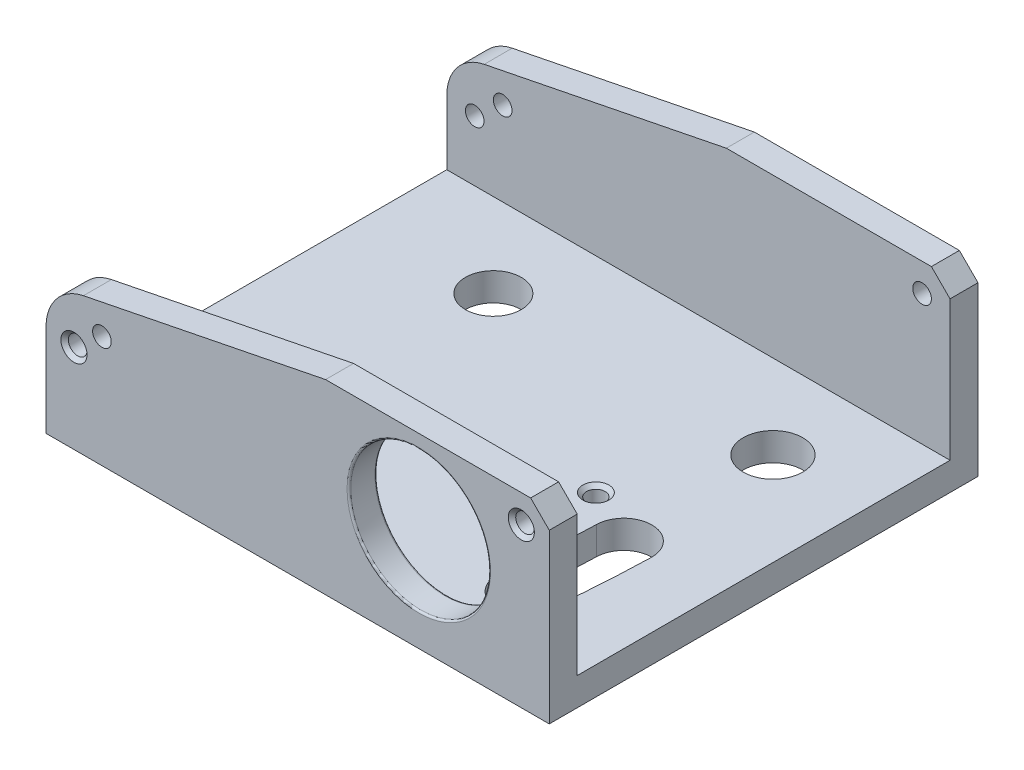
from build123d import *

# Parameters (mm, degrees)
SKETCH1_W      = 27
SKETCH1_H      = 23
SKETCH1_R      = 1.6
SKETCH1_R_2    = 1.5
SKETCH1_R_3    = 0.5
EXTRUDE1_DEPTH = 1.5
SKETCH2_R      = 0.5
SKETCH2_R_2    = 3.75
EXTRUDE2_DEPTH = 1.5
EXTRUDE3_START = -1.5
SKETCH3_R      = 0.5
EXTRUDE3_DEPTH = 1.5
FILLET1_R      = 0.1
CHAMFER1_SIZE  = 0.2
FILLET2_R      = 2.5


with BuildPart() as part:
    # Sketch1 → Extrude1 (new body)
    with BuildSketch(Plane(origin=(0, 0, 0), x_dir=(1, 0, 0), z_dir=(0, 1, 0))):
        with Locations((-8.5, -5.5)):
            Rectangle(SKETCH1_W, SKETCH1_H)
        with Locations(Location((0, 0, 0), (0, 0, 270))):
            Circle(SKETCH1_R, mode=Mode.SUBTRACT)
        with Locations(Location((-15, 0, 0), (0, 0, 270))):
            Circle(SKETCH1_R_2, mode=Mode.SUBTRACT)
        with Locations(Location((-3, -6.5, 0), (0, 0, 270))):
            Circle(SKETCH1_R_3, mode=Mode.SUBTRACT)
        with BuildLine():
            ThreePointArc((-1.814657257, -12.850061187), (-1.613249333, -10.406431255), (-1.49938813, -7.957160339))
            ThreePointArc((-1.49938813, -7.957160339), (0.042839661, -6.50061187), (1.49938813, -8.042839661))
            ThreePointArc((1.49938813, -8.042839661), (1.380542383, -10.599333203), (1.170317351, -13.149938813))
            ThreePointArc((1.170317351, -13.149938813), (-0.472108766, -14.492487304), (-1.814657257, -12.850061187))
        make_face(mode=Mode.SUBTRACT)
    extrude(amount=EXTRUDE1_DEPTH)

    # Sketch2 → Extrude2 (add)
    with BuildSketch(Plane.XY.offset(17)):
        Polygon((-22, 1.5), (5, 1.5), (5, 9), (4, 10), (-7, 10), (-22, 7), align=None)
        with Locations((3.5, 8.5)):
            Circle(SKETCH2_R, mode=Mode.SUBTRACT)
        with Locations((-2, 5.5)):
            Circle(SKETCH2_R_2, mode=Mode.SUBTRACT)
        with Locations((-20.5, 4.75)):
            Circle(SKETCH2_R, mode=Mode.SUBTRACT)
        with Locations((-19, 6)):
            Circle(SKETCH2_R, mode=Mode.SUBTRACT)
    extrude(amount=-EXTRUDE2_DEPTH)

    # Sketch3 → Extrude3 (add)
    with BuildSketch(Plane(origin=(0, 0, -6), x_dir=(-1, 0, 0), z_dir=(0, 0, -1)).offset(EXTRUDE3_START)):
        Polygon((-5, 1.5), (22, 1.5), (22, 7), (7, 10), (-4, 10), (-5, 9), align=None)
        with Locations(Location((-3.5, 8.5, 0), (0, 0, 180))):
            Circle(SKETCH3_R, mode=Mode.SUBTRACT)
        with Locations(Location((20.5, 4.75, 0), (0, 0, 180))):
            Circle(SKETCH3_R, mode=Mode.SUBTRACT)
        with Locations(Location((19, 6, 0), (0, 0, 180))):
            Circle(SKETCH3_R, mode=Mode.SUBTRACT)
    extrude(amount=EXTRUDE3_DEPTH)

    # Fillet1
    fillet1_edges = [part.edges().sort_by_distance(p)[0] for p in [
        (-5.75, 5.5, 15.5),
        (-5.75, 5.5, 17),
    ]]
    fillet(fillet1_edges, radius=FILLET1_R)

    # Chamfer1
    chamfer1_edges = [part.edges().sort_by_distance(p)[0] for p in [
        (-3, 0, 6),
        (-3, 1.5, 6),
        (3, 8.5, 17),
        (-21, 4.75, 17),
        (3, 8.5, -6),
        (-21, 4.75, -6),
    ]]
    chamfer(chamfer1_edges, length=CHAMFER1_SIZE)

    # Fillet2
    fillet2_edges = [part.edges().sort_by_distance(p)[0] for p in [
        (-22, 7, 16.25),
        (-22, 7, -5.25),
    ]]
    fillet(fillet2_edges, radius=FILLET2_R)


solid = part.part
